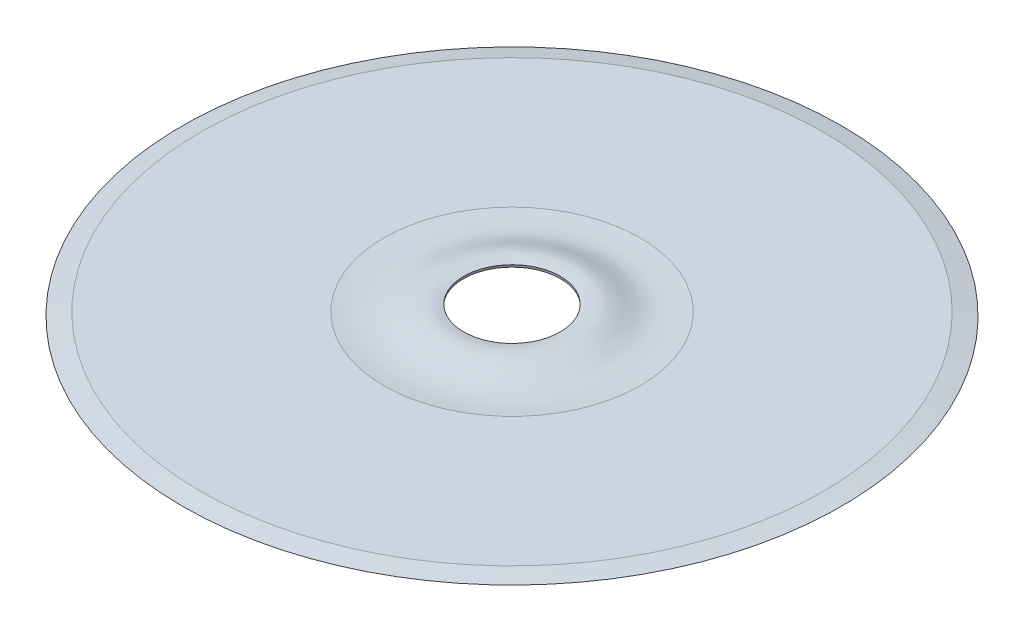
ISO-10303-21;
HEADER;
FILE_DESCRIPTION(('STEP AP214'),'2;1');
FILE_NAME('part.step','',(''),(''),'','','');
FILE_SCHEMA(('AUTOMOTIVE_DESIGN { 1 0 10303 214 1 1 1 1 }'));
ENDSEC;
DATA;
#1=APPLICATION_CONTEXT('core data for automotive mechanical design processes');
#2=APPLICATION_PROTOCOL_DEFINITION('international standard','automotive_design',2000,#1);
#3=PRODUCT_CONTEXT('',#1,'mechanical');
#4=PRODUCT('Part','Part','',(#3));
#5=PRODUCT_RELATED_PRODUCT_CATEGORY('part','',(#4));
#6=PRODUCT_DEFINITION_FORMATION('','',#4);
#7=PRODUCT_DEFINITION_CONTEXT('part definition',#1,'design');
#8=PRODUCT_DEFINITION('design','',#6,#7);
#9=PRODUCT_DEFINITION_SHAPE('','',#8);
#10=(LENGTH_UNIT() NAMED_UNIT(*) SI_UNIT(.MILLI.,.METRE.));
#11=(NAMED_UNIT(*) PLANE_ANGLE_UNIT() SI_UNIT($,.RADIAN.));
#12=(NAMED_UNIT(*) SI_UNIT($,.STERADIAN.) SOLID_ANGLE_UNIT());
#13=UNCERTAINTY_MEASURE_WITH_UNIT(LENGTH_MEASURE(1.E-05),#10,'distance_accuracy_value','');
#14=(GEOMETRIC_REPRESENTATION_CONTEXT(3) GLOBAL_UNCERTAINTY_ASSIGNED_CONTEXT((#13)) GLOBAL_UNIT_ASSIGNED_CONTEXT((#10,
#11,#12)) REPRESENTATION_CONTEXT('',''));
#15=CARTESIAN_POINT('',(0.,0.,0.));
#16=DIRECTION('',(0.,0.,1.));
#17=DIRECTION('',(1.,0.,0.));
#18=AXIS2_PLACEMENT_3D('',#15,#16,#17);
#19=CARTESIAN_POINT('',(70.,0.,0.));
#20=CARTESIAN_POINT('',(63.247393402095,-0.787669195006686,0.));
#21=CARTESIAN_POINT('',(50.6070630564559,-2.26212186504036,0.));
#22=CARTESIAN_POINT('',(36.7111873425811,5.7954808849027,0.));
#23=CARTESIAN_POINT('',(28.6365377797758,4.11134954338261,0.));
#24=CARTESIAN_POINT('',(26.3505220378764,3.63455476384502,0.));
#25=B_SPLINE_CURVE_WITH_KNOTS('',3,(#19,#20,#21,#22,#23,#24),.UNSPECIFIED.,.F.,.F.,(4,1,1,4),
(0.,0.451212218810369,0.844632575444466,1.),.UNSPECIFIED.);
#26=CARTESIAN_POINT('',(0.,70.,0.));
#27=DIRECTION('',(0.,1.,0.));
#28=AXIS1_PLACEMENT('',#26,#27);
#29=SURFACE_OF_REVOLUTION('',#25,#28);
#30=CARTESIAN_POINT('',(0.,3.63455476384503,0.));
#31=DIRECTION('',(0.,1.,0.));
#32=DIRECTION('',(0.,0.,1.));
#33=AXIS2_PLACEMENT_3D('',#30,#31,#32);
#34=CIRCLE('',#33,26.3505220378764);
#35=CARTESIAN_POINT('',(26.3505220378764,3.63455476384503,0.));
#36=VERTEX_POINT('',#35);
#37=EDGE_CURVE('E10',#36,#36,#34,.T.);
#38=ORIENTED_EDGE('',*,*,#37,.F.);
#39=EDGE_LOOP('',(#38));
#40=FACE_BOUND('',#39,.T.);
#41=CARTESIAN_POINT('',(0.,0.,0.));
#42=DIRECTION('',(0.,1.,0.));
#43=DIRECTION('',(0.,0.,1.));
#44=AXIS2_PLACEMENT_3D('',#41,#42,#43);
#45=CIRCLE('',#44,70.);
#46=CARTESIAN_POINT('',(0.,0.,70.));
#47=VERTEX_POINT('',#46);
#48=EDGE_CURVE('E53',#47,#47,#45,.T.);
#49=ORIENTED_EDGE('',*,*,#48,.T.);
#50=EDGE_LOOP('',(#49));
#51=FACE_BOUND('',#50,.T.);
#52=ADVANCED_FACE('F27',(#40,#51),#29,.T.);
#53=CARTESIAN_POINT('',(0.,0.,0.));
#54=DIRECTION('',(0.,1.,0.));
#55=DIRECTION('',(1.,0.,0.));
#56=AXIS2_PLACEMENT_3D('',#53,#54,#55);
#57=SPHERICAL_SURFACE('',#56,26.6);
#58=CARTESIAN_POINT('',(0.,2.37741504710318,0.));
#59=DIRECTION('',(0.,1.,0.));
#60=DIRECTION('',(0.,0.,1.));
#61=AXIS2_PLACEMENT_3D('',#58,#59,#60);
#62=CIRCLE('',#61,26.4935444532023);
#63=CARTESIAN_POINT('',(26.4935444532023,2.37741504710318,0.));
#64=VERTEX_POINT('',#63);
#65=EDGE_CURVE('E34',#64,#64,#62,.T.);
#66=CARTESIAN_POINT('',(26.4935444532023,2.37741504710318,0.));
#67=CARTESIAN_POINT('',(26.4923663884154,2.39054321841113,0.));
#68=CARTESIAN_POINT('',(26.491178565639,2.40367051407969,0.));
#69=CARTESIAN_POINT('',(26.4887834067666,2.42992332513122,0.));
#70=CARTESIAN_POINT('',(26.4875760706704,2.4430488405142,0.));
#71=CARTESIAN_POINT('',(26.4851418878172,2.46929806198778,0.));
#72=CARTESIAN_POINT('',(26.4839150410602,2.48242176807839,0.));
#73=CARTESIAN_POINT('',(26.481441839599,2.50866734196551,0.));
#74=CARTESIAN_POINT('',(26.4801954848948,2.52178920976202,0.));
#75=CARTESIAN_POINT('',(26.4776832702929,2.548031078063,0.));
#76=CARTESIAN_POINT('',(26.4764174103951,2.56115107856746,0.));
#77=CARTESIAN_POINT('',(26.4738661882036,2.58738918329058,0.));
#78=CARTESIAN_POINT('',(26.4725808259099,2.60050728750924,0.));
#79=CARTESIAN_POINT('',(26.4699906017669,2.62674157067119,0.));
#80=CARTESIAN_POINT('',(26.4686857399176,2.63985774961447,0.));
#81=CARTESIAN_POINT('',(26.4660565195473,2.66608815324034,0.));
#82=CARTESIAN_POINT('',(26.4647321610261,2.67920237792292,0.));
#83=CARTESIAN_POINT('',(26.4620639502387,2.70542884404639,0.));
#84=CARTESIAN_POINT('',(26.4607200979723,2.71854108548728,0.));
#85=CARTESIAN_POINT('',(26.4580129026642,2.74476355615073,0.));
#86=CARTESIAN_POINT('',(26.4566495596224,2.7578737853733,0.));
#87=CARTESIAN_POINT('',(26.4539033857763,2.78409220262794,0.));
#88=CARTESIAN_POINT('',(26.4525205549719,2.79720039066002,0.));
#89=CARTESIAN_POINT('',(26.4497354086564,2.82341469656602,0.));
#90=CARTESIAN_POINT('',(26.4483330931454,2.83652081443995,0.));
#91=CARTESIAN_POINT('',(26.4455089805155,2.86273095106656,0.));
#92=CARTESIAN_POINT('',(26.4440871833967,2.87583496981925,0.));
#93=CARTESIAN_POINT('',(26.4412241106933,2.90204087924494,0.));
#94=CARTESIAN_POINT('',(26.4397828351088,2.91514276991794,0.));
#95=CARTESIAN_POINT('',(26.4368808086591,2.94134439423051,0.));
#96=CARTESIAN_POINT('',(26.4354200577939,2.95444412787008,0.));
#97=CARTESIAN_POINT('',(26.432479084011,2.98064140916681,0.));
#98=CARTESIAN_POINT('',(26.4309988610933,2.99373895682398,0.));
#99=CARTESIAN_POINT('',(26.4280189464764,3.01993183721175,0.));
#100=CARTESIAN_POINT('',(26.4265192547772,3.03302716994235,0.));
#101=CARTESIAN_POINT('',(26.4235004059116,3.05921559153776,0.));
#102=CARTESIAN_POINT('',(26.4219812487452,3.07230868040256,0.));
#103=CARTESIAN_POINT('',(26.4189234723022,3.09849258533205,0.));
#104=CARTESIAN_POINT('',(26.4173848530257,3.11158340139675,0.));
#105=CARTESIAN_POINT('',(26.4142881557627,3.13776273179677,0.));
#106=CARTESIAN_POINT('',(26.4127300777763,3.15085124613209,0.));
#107=CARTESIAN_POINT('',(26.4095944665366,3.17702594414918,0.));
#108=CARTESIAN_POINT('',(26.4080169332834,3.19011212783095,0.));
#109=CARTESIAN_POINT('',(26.4048424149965,3.21628213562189,0.));
#110=CARTESIAN_POINT('',(26.4032454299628,3.22936595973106,0.));
#111=CARTESIAN_POINT('',(26.4000320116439,3.255531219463,0.));
#112=CARTESIAN_POINT('',(26.3984155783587,3.26861265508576,0.));
#113=CARTESIAN_POINT('',(26.3951632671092,3.29477310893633,0.));
#114=CARTESIAN_POINT('',(26.3935273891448,3.30785212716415,0.));
#115=CARTESIAN_POINT('',(26.3902361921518,3.33400771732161,0.));
#116=CARTESIAN_POINT('',(26.3885808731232,3.34708428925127,0.));
#117=CARTESIAN_POINT('',(26.3852507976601,3.37323495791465,0.));
#118=CARTESIAN_POINT('',(26.3835760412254,3.38630905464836,0.));
#119=CARTESIAN_POINT('',(26.3802070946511,3.41245474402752,0.));
#120=CARTESIAN_POINT('',(26.3785129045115,3.42552633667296,0.));
#121=CARTESIAN_POINT('',(26.3751050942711,3.4516669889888,0.));
#122=CARTESIAN_POINT('',(26.3733914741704,3.46473604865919,0.));
#123=CARTESIAN_POINT('',(26.3699448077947,3.49087160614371,0.));
#124=CARTESIAN_POINT('',(26.3682117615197,3.50393810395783,0.));
#125=CARTESIAN_POINT('',(26.3647262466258,3.53006850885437,0.));
#126=CARTESIAN_POINT('',(26.362973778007,3.54313241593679,0.));
#127=CARTESIAN_POINT('',(26.359449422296,3.56925761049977,0.));
#128=CARTESIAN_POINT('',(26.3576775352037,3.58231889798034,0.));
#129=CARTESIAN_POINT('',(26.3541143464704,3.60843882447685,0.));
#130=CARTESIAN_POINT('',(26.3523230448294,3.62149746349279,0.));
#131=CARTESIAN_POINT('',(26.3505220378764,3.63455476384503,0.));
#132=B_SPLINE_CURVE_WITH_KNOTS('',3,(#66,#67,#68,#69,#70,#71,#72,#73,#74,#75,#76,#77,#78,#79,
#80,#81,#82,#83,#84,#85,#86,#87,#88,#89,#90,#91,#92,#93,#94,#95,#96,#97,#98,#99,#100,#101,#102,
#103,#104,#105,#106,#107,#108,#109,#110,#111,#112,#113,#114,#115,#116,#117,#118,#119,#120,#121,
#122,#123,#124,#125,#126,#127,#128,#129,#130,#131),.UNSPECIFIED.,.F.,.F.,(4,2,2,2,2,2,2,2,2,2,2,
2,2,2,2,2,2,2,2,2,2,2,2,2,2,2,2,2,2,2,2,2,4),(0.,0.0395427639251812,0.0790855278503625,
0.118628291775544,0.158171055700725,0.197713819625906,0.237256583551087,0.276799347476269,
0.31634211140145,0.355884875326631,0.395427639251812,0.434970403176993,0.474513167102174,
0.514055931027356,0.553598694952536,0.593141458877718,0.632684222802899,0.67222698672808,
0.711769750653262,0.751312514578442,0.790855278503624,0.830398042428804,0.869940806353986,
0.909483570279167,0.949026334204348,0.98856909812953,1.02811186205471,1.06765462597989,
1.10719738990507,1.14674015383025,1.18628291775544,1.22582568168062,1.2653684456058),.UNSPECIFIED.);
#133=EDGE_CURVE('BSEAM90',#64,#36,#132,.T.);
#134=ORIENTED_EDGE('',*,*,#65,.F.);
#135=ORIENTED_EDGE('',*,*,#37,.T.);
#136=ORIENTED_EDGE('',*,*,#133,.T.);
#137=ORIENTED_EDGE('',*,*,#133,.F.);
#138=EDGE_LOOP('',(#134,#136,#135,#137));
#139=FACE_BOUND('',#138,.T.);
#140=ADVANCED_FACE('F90',(#139),#57,.F.);
#141=CARTESIAN_POINT('',(0.,2.37741504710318,0.));
#142=DIRECTION('',(0.,1.,0.));
#143=DIRECTION('',(0.,0.,1.));
#144=AXIS2_PLACEMENT_3D('',#141,#142,#143);
#145=CONICAL_SURFACE('',#144,26.4935444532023,1.4276401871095);
#146=CARTESIAN_POINT('',(0.,3.63455476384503,0.));
#147=DIRECTION('',(0.,1.,0.));
#148=DIRECTION('',(0.,0.,1.));
#149=AXIS2_PLACEMENT_3D('',#146,#147,#148);
#150=CIRCLE('',#149,35.2150715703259);
#151=CARTESIAN_POINT('',(0.,3.63455476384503,35.2150715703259));
#152=VERTEX_POINT('',#151);
#153=EDGE_CURVE('E38',#152,#152,#150,.T.);
#154=ORIENTED_EDGE('',*,*,#153,.F.);
#155=EDGE_LOOP('',(#154));
#156=FACE_BOUND('',#155,.T.);
#157=ORIENTED_EDGE('',*,*,#65,.T.);
#158=EDGE_LOOP('',(#157));
#159=FACE_BOUND('',#158,.T.);
#160=ADVANCED_FACE('F85',(#156,#159),#145,.T.);
#161=CARTESIAN_POINT('',(0.,3.63455476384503,0.));
#162=DIRECTION('',(0.,-1.,0.));
#163=DIRECTION('',(0.,0.,-1.));
#164=AXIS2_PLACEMENT_3D('',#161,#162,#163);
#165=CONICAL_SURFACE('',#164,35.2150715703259,1.20668737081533);
#166=CARTESIAN_POINT('',(0.,-2.,0.));
#167=DIRECTION('',(0.,1.,0.));
#168=DIRECTION('',(0.,0.,1.));
#169=AXIS2_PLACEMENT_3D('',#166,#167,#168);
#170=CIRCLE('',#169,50.);
#171=CARTESIAN_POINT('',(0.,-2.,50.));
#172=VERTEX_POINT('',#171);
#173=EDGE_CURVE('E42',#172,#172,#170,.T.);
#174=ORIENTED_EDGE('',*,*,#173,.F.);
#175=EDGE_LOOP('',(#174));
#176=FACE_BOUND('',#175,.T.);
#177=ORIENTED_EDGE('',*,*,#153,.T.);
#178=EDGE_LOOP('',(#177));
#179=FACE_BOUND('',#178,.T.);
#180=ADVANCED_FACE('F79',(#176,#179),#165,.F.);
#181=CARTESIAN_POINT('',(50.,-2.,0.));
#182=DIRECTION('',(0.,1.,0.));
#183=DIRECTION('',(0.,0.,1.));
#184=AXIS2_PLACEMENT_3D('',#181,#182,#183);
#185=PLANE('',#184);
#186=CARTESIAN_POINT('',(0.,-2.,0.));
#187=DIRECTION('',(0.,1.,0.));
#188=DIRECTION('',(0.,0.,1.));
#189=AXIS2_PLACEMENT_3D('',#186,#187,#188);
#190=CIRCLE('',#189,180.);
#191=CARTESIAN_POINT('',(0.,-2.,180.));
#192=VERTEX_POINT('',#191);
#193=EDGE_CURVE('E47',#192,#192,#190,.T.);
#194=ORIENTED_EDGE('',*,*,#193,.F.);
#195=EDGE_LOOP('',(#194));
#196=FACE_BOUND('',#195,.T.);
#197=ORIENTED_EDGE('',*,*,#173,.T.);
#198=EDGE_LOOP('',(#197));
#199=FACE_BOUND('',#198,.T.);
#200=ADVANCED_FACE('F73',(#196,#199),#185,.F.);
#201=CARTESIAN_POINT('',(0.,-2.,0.));
#202=DIRECTION('',(0.,-1.,0.));
#203=DIRECTION('',(0.,0.,-1.));
#204=AXIS2_PLACEMENT_3D('',#201,#202,#203);
#205=CONICAL_SURFACE('',#204,180.,1.37340076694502);
#206=CARTESIAN_POINT('',(0.,0.,0.));
#207=DIRECTION('',(0.,1.,0.));
#208=DIRECTION('',(0.,0.,1.));
#209=AXIS2_PLACEMENT_3D('',#206,#207,#208);
#210=CIRCLE('',#209,170.);
#211=CARTESIAN_POINT('',(0.,0.,170.));
#212=VERTEX_POINT('',#211);
#213=EDGE_CURVE('E50',#212,#212,#210,.T.);
#214=ORIENTED_EDGE('',*,*,#213,.F.);
#215=EDGE_LOOP('',(#214));
#216=FACE_BOUND('',#215,.T.);
#217=ORIENTED_EDGE('',*,*,#193,.T.);
#218=EDGE_LOOP('',(#217));
#219=FACE_BOUND('',#218,.T.);
#220=ADVANCED_FACE('F67',(#216,#219),#205,.T.);
#221=CARTESIAN_POINT('',(70.,0.,0.));
#222=DIRECTION('',(0.,-1.,0.));
#223=DIRECTION('',(0.,0.,-1.));
#224=AXIS2_PLACEMENT_3D('',#221,#222,#223);
#225=PLANE('',#224);
#226=ORIENTED_EDGE('',*,*,#48,.F.);
#227=EDGE_LOOP('',(#226));
#228=FACE_BOUND('',#227,.T.);
#229=ORIENTED_EDGE('',*,*,#213,.T.);
#230=EDGE_LOOP('',(#229));
#231=FACE_BOUND('',#230,.T.);
#232=ADVANCED_FACE('F64',(#228,#231),#225,.F.);
#233=CLOSED_SHELL('',(#52,#140,#160,#180,#200,#220,#232));
#234=MANIFOLD_SOLID_BREP('B2',#233);
#235=ADVANCED_BREP_SHAPE_REPRESENTATION('',(#18,#234),#14);
#236=SHAPE_DEFINITION_REPRESENTATION(#9,#235);
ENDSEC;
END-ISO-10303-21;
